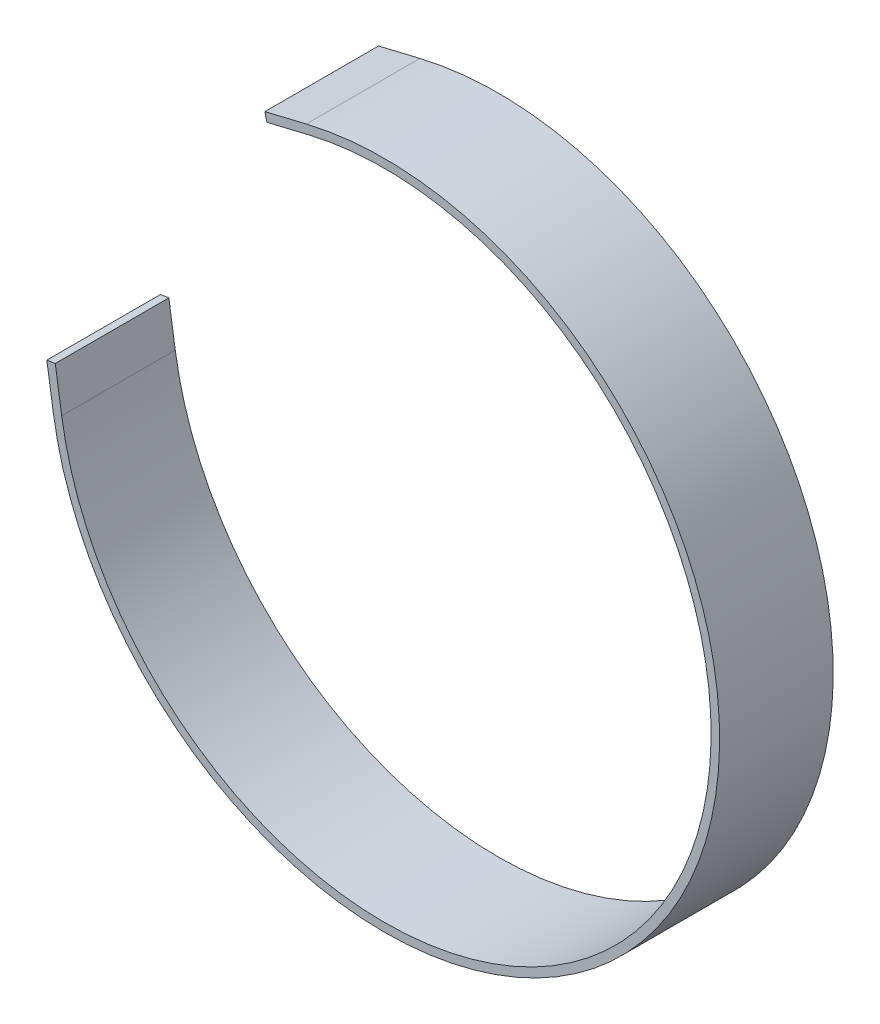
ISO-10303-21;
HEADER;
FILE_DESCRIPTION(('STEP AP214'),'2;1');
FILE_NAME('part.step','',(''),(''),'','','');
FILE_SCHEMA(('AUTOMOTIVE_DESIGN { 1 0 10303 214 1 1 1 1 }'));
ENDSEC;
DATA;
#1=APPLICATION_CONTEXT('core data for automotive mechanical design processes');
#2=APPLICATION_PROTOCOL_DEFINITION('international standard','automotive_design',2000,#1);
#3=PRODUCT_CONTEXT('',#1,'mechanical');
#4=PRODUCT('Part','Part','',(#3));
#5=PRODUCT_RELATED_PRODUCT_CATEGORY('part','',(#4));
#6=PRODUCT_DEFINITION_FORMATION('','',#4);
#7=PRODUCT_DEFINITION_CONTEXT('part definition',#1,'design');
#8=PRODUCT_DEFINITION('design','',#6,#7);
#9=PRODUCT_DEFINITION_SHAPE('','',#8);
#10=(LENGTH_UNIT() NAMED_UNIT(*) SI_UNIT(.MILLI.,.METRE.));
#11=(NAMED_UNIT(*) PLANE_ANGLE_UNIT() SI_UNIT($,.RADIAN.));
#12=(NAMED_UNIT(*) SI_UNIT($,.STERADIAN.) SOLID_ANGLE_UNIT());
#13=UNCERTAINTY_MEASURE_WITH_UNIT(LENGTH_MEASURE(1.E-05),#10,'distance_accuracy_value','');
#14=(GEOMETRIC_REPRESENTATION_CONTEXT(3) GLOBAL_UNCERTAINTY_ASSIGNED_CONTEXT((#13)) GLOBAL_UNIT_ASSIGNED_CONTEXT((#10,
#11,#12)) REPRESENTATION_CONTEXT('',''));
#15=CARTESIAN_POINT('',(0.,0.,0.));
#16=DIRECTION('',(0.,0.,1.));
#17=DIRECTION('',(1.,0.,0.));
#18=AXIS2_PLACEMENT_3D('',#15,#16,#17);
#19=CARTESIAN_POINT('',(0.,0.,80.));
#20=DIRECTION('',(0.,0.,-1.));
#21=DIRECTION('',(-1.,0.,0.));
#22=AXIS2_PLACEMENT_3D('',#19,#20,#21);
#23=CYLINDRICAL_SURFACE('',#22,236.);
#24=CARTESIAN_POINT('',(0.,0.,0.));
#25=DIRECTION('',(0.,0.,1.));
#26=DIRECTION('',(1.,0.,0.));
#27=AXIS2_PLACEMENT_3D('',#24,#25,#26);
#28=CIRCLE('',#27,236.);
#29=CARTESIAN_POINT('',(-233.309422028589,-35.5346815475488,0.));
#30=VERTEX_POINT('',#29);
#31=CARTESIAN_POINT('',(-55.0931058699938,229.479301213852,0.));
#32=VERTEX_POINT('',#31);
#33=EDGE_CURVE('E99',#30,#32,#28,.T.);
#34=ORIENTED_EDGE('',*,*,#33,.T.);
#35=DIRECTION('',(0.,0.,-1.));
#36=VECTOR('',#35,1.);
#37=CARTESIAN_POINT('',(-55.0931058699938,229.479301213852,80.));
#38=LINE('',#37,#36);
#39=CARTESIAN_POINT('',(-55.0931058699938,229.479301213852,80.));
#40=VERTEX_POINT('',#39);
#41=EDGE_CURVE('E11',#40,#32,#38,.T.);
#42=ORIENTED_EDGE('',*,*,#41,.F.);
#43=CARTESIAN_POINT('',(0.,0.,80.));
#44=DIRECTION('',(0.,0.,1.));
#45=DIRECTION('',(1.,0.,0.));
#46=AXIS2_PLACEMENT_3D('',#43,#44,#45);
#47=CIRCLE('',#46,236.);
#48=CARTESIAN_POINT('',(-233.309422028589,-35.5346815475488,80.));
#49=VERTEX_POINT('',#48);
#50=EDGE_CURVE('E126',#49,#40,#47,.T.);
#51=ORIENTED_EDGE('',*,*,#50,.F.);
#52=DIRECTION('',(0.,0.,-1.));
#53=VECTOR('',#52,1.);
#54=CARTESIAN_POINT('',(-233.309422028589,-35.5346815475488,80.));
#55=LINE('',#54,#53);
#56=EDGE_CURVE('E112',#49,#30,#55,.T.);
#57=ORIENTED_EDGE('',*,*,#56,.T.);
#58=EDGE_LOOP('',(#34,#42,#51,#57));
#59=FACE_BOUND('',#58,.T.);
#60=ADVANCED_FACE('F31',(#59),#23,.T.);
#61=CARTESIAN_POINT('',(-55.0931058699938,229.479301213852,80.));
#62=DIRECTION('',(0.233445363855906,-0.972369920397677,0.));
#63=DIRECTION('',(0.972369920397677,0.233445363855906,0.));
#64=AXIS2_PLACEMENT_3D('',#61,#62,#63);
#65=PLANE('',#64);
#66=DIRECTION('',(-0.972369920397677,-0.233445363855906,0.));
#67=VECTOR('',#66,1.);
#68=CARTESIAN_POINT('',(-55.0931058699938,229.479301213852,0.));
#69=LINE('',#68,#67);
#70=CARTESIAN_POINT('',(-84.2642034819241,222.475940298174,0.));
#71=VERTEX_POINT('',#70);
#72=EDGE_CURVE('E95',#32,#71,#69,.T.);
#73=ORIENTED_EDGE('',*,*,#72,.T.);
#74=DIRECTION('',(0.,0.,-1.));
#75=VECTOR('',#74,1.);
#76=CARTESIAN_POINT('',(-84.2642034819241,222.475940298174,80.));
#77=LINE('',#76,#75);
#78=CARTESIAN_POINT('',(-84.2642034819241,222.475940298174,80.));
#79=VERTEX_POINT('',#78);
#80=EDGE_CURVE('E38',#79,#71,#77,.T.);
#81=ORIENTED_EDGE('',*,*,#80,.F.);
#82=DIRECTION('',(-0.972369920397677,-0.233445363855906,0.));
#83=VECTOR('',#82,1.);
#84=CARTESIAN_POINT('',(-55.0931058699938,229.479301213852,80.));
#85=LINE('',#84,#83);
#86=EDGE_CURVE('E108',#40,#79,#85,.T.);
#87=ORIENTED_EDGE('',*,*,#86,.F.);
#88=ORIENTED_EDGE('',*,*,#41,.T.);
#89=EDGE_LOOP('',(#73,#81,#87,#88));
#90=FACE_BOUND('',#89,.T.);
#91=ADVANCED_FACE('F107',(#90),#65,.F.);
#92=CARTESIAN_POINT('',(-82.8635312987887,216.641720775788,80.));
#93=DIRECTION('',(0.972369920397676,0.233445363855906,0.));
#94=DIRECTION('',(-0.233445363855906,0.972369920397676,0.));
#95=AXIS2_PLACEMENT_3D('',#92,#93,#94);
#96=PLANE('',#95);
#97=DIRECTION('',(0.233445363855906,-0.972369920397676,0.));
#98=VECTOR('',#97,1.);
#99=CARTESIAN_POINT('',(-82.8635312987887,216.641720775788,0.));
#100=LINE('',#99,#98);
#101=CARTESIAN_POINT('',(-82.8635312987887,216.641720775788,0.));
#102=VERTEX_POINT('',#101);
#103=EDGE_CURVE('E101',#71,#102,#100,.T.);
#104=ORIENTED_EDGE('',*,*,#103,.T.);
#105=DIRECTION('',(0.,0.,-1.));
#106=VECTOR('',#105,1.);
#107=CARTESIAN_POINT('',(-82.8635312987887,216.641720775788,80.));
#108=LINE('',#107,#106);
#109=CARTESIAN_POINT('',(-82.8635312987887,216.641720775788,80.));
#110=VERTEX_POINT('',#109);
#111=EDGE_CURVE('E152',#110,#102,#108,.T.);
#112=ORIENTED_EDGE('',*,*,#111,.F.);
#113=DIRECTION('',(0.233445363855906,-0.972369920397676,0.));
#114=VECTOR('',#113,1.);
#115=CARTESIAN_POINT('',(-82.8635312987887,216.641720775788,80.));
#116=LINE('',#115,#114);
#117=EDGE_CURVE('E129',#79,#110,#116,.T.);
#118=ORIENTED_EDGE('',*,*,#117,.F.);
#119=ORIENTED_EDGE('',*,*,#80,.T.);
#120=EDGE_LOOP('',(#104,#112,#118,#119));
#121=FACE_BOUND('',#120,.T.);
#122=ADVANCED_FACE('F156',(#121),#96,.F.);
#123=CARTESIAN_POINT('',(-53.6924336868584,223.645081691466,80.));
#124=DIRECTION('',(-0.233445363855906,0.972369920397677,0.));
#125=DIRECTION('',(-0.972369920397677,-0.233445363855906,0.));
#126=AXIS2_PLACEMENT_3D('',#123,#124,#125);
#127=PLANE('',#126);
#128=DIRECTION('',(0.972369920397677,0.233445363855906,0.));
#129=VECTOR('',#128,1.);
#130=CARTESIAN_POINT('',(-53.6924336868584,223.645081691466,0.));
#131=LINE('',#130,#129);
#132=CARTESIAN_POINT('',(-53.6924336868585,223.645081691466,0.));
#133=VERTEX_POINT('',#132);
#134=EDGE_CURVE('E116',#102,#133,#131,.T.);
#135=ORIENTED_EDGE('',*,*,#134,.T.);
#136=DIRECTION('',(0.,0.,-1.));
#137=VECTOR('',#136,1.);
#138=CARTESIAN_POINT('',(-53.6924336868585,223.645081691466,80.));
#139=LINE('',#138,#137);
#140=CARTESIAN_POINT('',(-53.6924336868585,223.645081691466,80.));
#141=VERTEX_POINT('',#140);
#142=EDGE_CURVE('E149',#141,#133,#139,.T.);
#143=ORIENTED_EDGE('',*,*,#142,.F.);
#144=DIRECTION('',(0.972369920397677,0.233445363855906,0.));
#145=VECTOR('',#144,1.);
#146=CARTESIAN_POINT('',(-53.6924336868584,223.645081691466,80.));
#147=LINE('',#146,#145);
#148=EDGE_CURVE('E131',#110,#141,#147,.T.);
#149=ORIENTED_EDGE('',*,*,#148,.F.);
#150=ORIENTED_EDGE('',*,*,#111,.T.);
#151=EDGE_LOOP('',(#135,#143,#149,#150));
#152=FACE_BOUND('',#151,.T.);
#153=ADVANCED_FACE('F164',(#152),#127,.F.);
#154=CARTESIAN_POINT('',(0.,0.,80.));
#155=DIRECTION('',(0.,0.,-1.));
#156=DIRECTION('',(-1.,0.,0.));
#157=AXIS2_PLACEMENT_3D('',#154,#155,#156);
#158=CYLINDRICAL_SURFACE('',#157,230.);
#159=CARTESIAN_POINT('',(0.,0.,0.));
#160=DIRECTION('',(0.,0.,-1.));
#161=DIRECTION('',(1.,0.,0.));
#162=AXIS2_PLACEMENT_3D('',#159,#160,#161);
#163=CIRCLE('',#162,230.);
#164=CARTESIAN_POINT('',(-227.377826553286,-34.6312574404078,0.));
#165=VERTEX_POINT('',#164);
#166=EDGE_CURVE('E118',#133,#165,#163,.T.);
#167=ORIENTED_EDGE('',*,*,#166,.T.);
#168=DIRECTION('',(0.,0.,-1.));
#169=VECTOR('',#168,1.);
#170=CARTESIAN_POINT('',(-227.377826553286,-34.6312574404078,80.));
#171=LINE('',#170,#169);
#172=CARTESIAN_POINT('',(-227.377826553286,-34.6312574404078,80.));
#173=VERTEX_POINT('',#172);
#174=EDGE_CURVE('E146',#173,#165,#171,.T.);
#175=ORIENTED_EDGE('',*,*,#174,.F.);
#176=CARTESIAN_POINT('',(0.,0.,80.));
#177=DIRECTION('',(0.,0.,-1.));
#178=DIRECTION('',(1.,0.,0.));
#179=AXIS2_PLACEMENT_3D('',#176,#177,#178);
#180=CIRCLE('',#179,230.);
#181=EDGE_CURVE('E133',#141,#173,#180,.T.);
#182=ORIENTED_EDGE('',*,*,#181,.F.);
#183=ORIENTED_EDGE('',*,*,#142,.T.);
#184=EDGE_LOOP('',(#167,#175,#182,#183));
#185=FACE_BOUND('',#184,.T.);
#186=ADVANCED_FACE('F167',(#185),#158,.F.);
#187=CARTESIAN_POINT('',(-227.377826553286,-34.6312574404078,80.));
#188=DIRECTION('',(-0.988599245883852,-0.150570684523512,0.));
#189=DIRECTION('',(0.150570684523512,-0.988599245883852,0.));
#190=AXIS2_PLACEMENT_3D('',#187,#188,#189);
#191=PLANE('',#190);
#192=DIRECTION('',(-0.150570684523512,0.988599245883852,0.));
#193=VECTOR('',#192,1.);
#194=CARTESIAN_POINT('',(-227.377826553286,-34.6312574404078,0.));
#195=LINE('',#194,#193);
#196=CARTESIAN_POINT('',(-231.894947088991,-4.97328006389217,0.));
#197=VERTEX_POINT('',#196);
#198=EDGE_CURVE('E120',#165,#197,#195,.T.);
#199=ORIENTED_EDGE('',*,*,#198,.T.);
#200=DIRECTION('',(0.,0.,-1.));
#201=VECTOR('',#200,1.);
#202=CARTESIAN_POINT('',(-231.894947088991,-4.97328006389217,80.));
#203=LINE('',#202,#201);
#204=CARTESIAN_POINT('',(-231.894947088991,-4.97328006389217,80.));
#205=VERTEX_POINT('',#204);
#206=EDGE_CURVE('E143',#205,#197,#203,.T.);
#207=ORIENTED_EDGE('',*,*,#206,.F.);
#208=DIRECTION('',(-0.150570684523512,0.988599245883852,0.));
#209=VECTOR('',#208,1.);
#210=CARTESIAN_POINT('',(-227.377826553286,-34.6312574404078,80.));
#211=LINE('',#210,#209);
#212=EDGE_CURVE('E135',#173,#205,#211,.T.);
#213=ORIENTED_EDGE('',*,*,#212,.F.);
#214=ORIENTED_EDGE('',*,*,#174,.T.);
#215=EDGE_LOOP('',(#199,#207,#213,#214));
#216=FACE_BOUND('',#215,.T.);
#217=ADVANCED_FACE('F172',(#216),#191,.F.);
#218=CARTESIAN_POINT('',(-231.894947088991,-4.97328006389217,80.));
#219=DIRECTION('',(0.150570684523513,-0.988599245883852,0.));
#220=DIRECTION('',(0.988599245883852,0.150570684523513,0.));
#221=AXIS2_PLACEMENT_3D('',#218,#219,#220);
#222=PLANE('',#221);
#223=DIRECTION('',(-0.988599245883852,-0.150570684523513,0.));
#224=VECTOR('',#223,1.);
#225=CARTESIAN_POINT('',(-231.894947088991,-4.97328006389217,0.));
#226=LINE('',#225,#224);
#227=CARTESIAN_POINT('',(-237.826542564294,-5.87670417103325,0.));
#228=VERTEX_POINT('',#227);
#229=EDGE_CURVE('E122',#197,#228,#226,.T.);
#230=ORIENTED_EDGE('',*,*,#229,.T.);
#231=DIRECTION('',(0.,0.,-1.));
#232=VECTOR('',#231,1.);
#233=CARTESIAN_POINT('',(-237.826542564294,-5.87670417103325,80.));
#234=LINE('',#233,#232);
#235=CARTESIAN_POINT('',(-237.826542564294,-5.87670417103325,80.));
#236=VERTEX_POINT('',#235);
#237=EDGE_CURVE('E140',#236,#228,#234,.T.);
#238=ORIENTED_EDGE('',*,*,#237,.F.);
#239=DIRECTION('',(-0.988599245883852,-0.150570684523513,0.));
#240=VECTOR('',#239,1.);
#241=CARTESIAN_POINT('',(-231.894947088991,-4.97328006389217,80.));
#242=LINE('',#241,#240);
#243=EDGE_CURVE('E50',#205,#236,#242,.T.);
#244=ORIENTED_EDGE('',*,*,#243,.F.);
#245=ORIENTED_EDGE('',*,*,#206,.T.);
#246=EDGE_LOOP('',(#230,#238,#244,#245));
#247=FACE_BOUND('',#246,.T.);
#248=ADVANCED_FACE('F175',(#247),#222,.F.);
#249=CARTESIAN_POINT('',(-233.309422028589,-35.5346815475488,80.));
#250=DIRECTION('',(0.988599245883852,0.150570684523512,0.));
#251=DIRECTION('',(-0.150570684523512,0.988599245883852,0.));
#252=AXIS2_PLACEMENT_3D('',#249,#250,#251);
#253=PLANE('',#252);
#254=DIRECTION('',(0.150570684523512,-0.988599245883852,0.));
#255=VECTOR('',#254,1.);
#256=CARTESIAN_POINT('',(-233.309422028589,-35.5346815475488,0.));
#257=LINE('',#256,#255);
#258=EDGE_CURVE('E124',#228,#30,#257,.T.);
#259=ORIENTED_EDGE('',*,*,#258,.T.);
#260=ORIENTED_EDGE('',*,*,#56,.F.);
#261=DIRECTION('',(0.150570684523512,-0.988599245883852,0.));
#262=VECTOR('',#261,1.);
#263=CARTESIAN_POINT('',(-233.309422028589,-35.5346815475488,80.));
#264=LINE('',#263,#262);
#265=EDGE_CURVE('E45',#236,#49,#264,.T.);
#266=ORIENTED_EDGE('',*,*,#265,.F.);
#267=ORIENTED_EDGE('',*,*,#237,.T.);
#268=EDGE_LOOP('',(#259,#260,#266,#267));
#269=FACE_BOUND('',#268,.T.);
#270=ADVANCED_FACE('F177',(#269),#253,.F.);
#271=CARTESIAN_POINT('',(0.,0.,80.));
#272=DIRECTION('',(0.,0.,1.));
#273=DIRECTION('',(1.,0.,0.));
#274=AXIS2_PLACEMENT_3D('',#271,#272,#273);
#275=PLANE('',#274);
#276=ORIENTED_EDGE('',*,*,#50,.T.);
#277=ORIENTED_EDGE('',*,*,#86,.T.);
#278=ORIENTED_EDGE('',*,*,#117,.T.);
#279=ORIENTED_EDGE('',*,*,#148,.T.);
#280=ORIENTED_EDGE('',*,*,#181,.T.);
#281=ORIENTED_EDGE('',*,*,#212,.T.);
#282=ORIENTED_EDGE('',*,*,#243,.T.);
#283=ORIENTED_EDGE('',*,*,#265,.T.);
#284=EDGE_LOOP('',(#276,#277,#278,#279,#280,#281,#282,#283));
#285=FACE_BOUND('',#284,.T.);
#286=ADVANCED_FACE('F159',(#285),#275,.T.);
#287=CARTESIAN_POINT('',(0.,0.,0.));
#288=DIRECTION('',(0.,0.,1.));
#289=DIRECTION('',(1.,0.,0.));
#290=AXIS2_PLACEMENT_3D('',#287,#288,#289);
#291=PLANE('',#290);
#292=ORIENTED_EDGE('',*,*,#33,.F.);
#293=ORIENTED_EDGE('',*,*,#258,.F.);
#294=ORIENTED_EDGE('',*,*,#229,.F.);
#295=ORIENTED_EDGE('',*,*,#198,.F.);
#296=ORIENTED_EDGE('',*,*,#166,.F.);
#297=ORIENTED_EDGE('',*,*,#134,.F.);
#298=ORIENTED_EDGE('',*,*,#103,.F.);
#299=ORIENTED_EDGE('',*,*,#72,.F.);
#300=EDGE_LOOP('',(#292,#293,#294,#295,#296,#297,#298,#299));
#301=FACE_BOUND('',#300,.T.);
#302=ADVANCED_FACE('F96',(#301),#291,.F.);
#303=CLOSED_SHELL('',(#60,#91,#122,#153,#186,#217,#248,#270,#286,#302));
#304=MANIFOLD_SOLID_BREP('B2',#303);
#305=ADVANCED_BREP_SHAPE_REPRESENTATION('',(#18,#304),#14);
#306=SHAPE_DEFINITION_REPRESENTATION(#9,#305);
ENDSEC;
END-ISO-10303-21;
